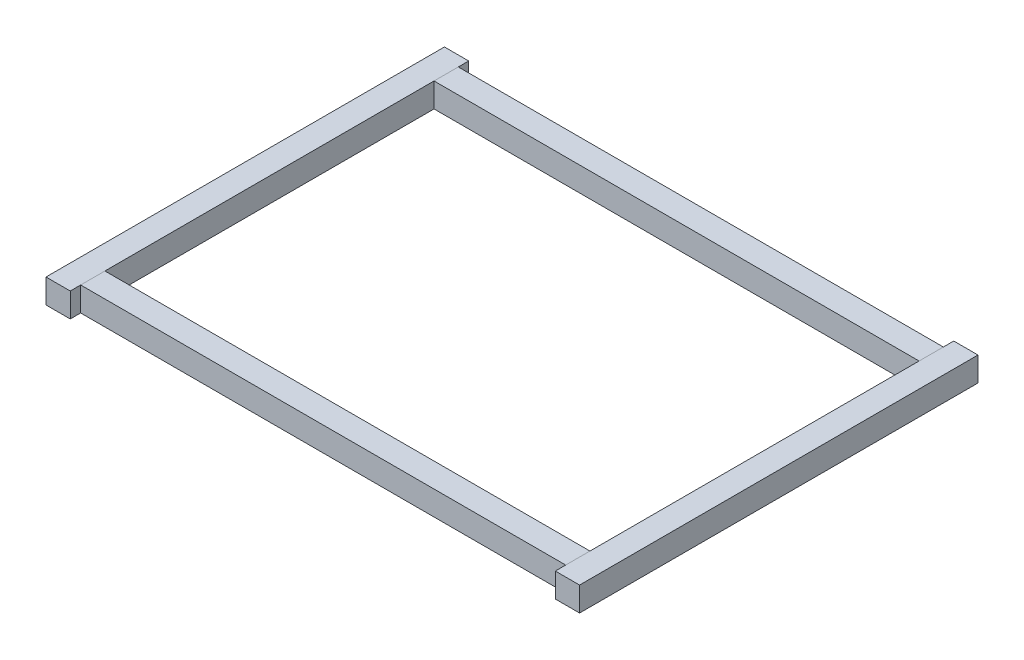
ISO-10303-21;
HEADER;
FILE_DESCRIPTION(('STEP AP214'),'2;1');
FILE_NAME('part.step','',(''),(''),'','','');
FILE_SCHEMA(('AUTOMOTIVE_DESIGN { 1 0 10303 214 1 1 1 1 }'));
ENDSEC;
DATA;
#1=APPLICATION_CONTEXT('core data for automotive mechanical design processes');
#2=APPLICATION_PROTOCOL_DEFINITION('international standard','automotive_design',2000,#1);
#3=PRODUCT_CONTEXT('',#1,'mechanical');
#4=PRODUCT('Part','Part','',(#3));
#5=PRODUCT_RELATED_PRODUCT_CATEGORY('part','',(#4));
#6=PRODUCT_DEFINITION_FORMATION('','',#4);
#7=PRODUCT_DEFINITION_CONTEXT('part definition',#1,'design');
#8=PRODUCT_DEFINITION('design','',#6,#7);
#9=PRODUCT_DEFINITION_SHAPE('','',#8);
#10=(LENGTH_UNIT() NAMED_UNIT(*) SI_UNIT(.MILLI.,.METRE.));
#11=(NAMED_UNIT(*) PLANE_ANGLE_UNIT() SI_UNIT($,.RADIAN.));
#12=(NAMED_UNIT(*) SI_UNIT($,.STERADIAN.) SOLID_ANGLE_UNIT());
#13=UNCERTAINTY_MEASURE_WITH_UNIT(LENGTH_MEASURE(1.E-05),#10,'distance_accuracy_value','');
#14=(GEOMETRIC_REPRESENTATION_CONTEXT(3) GLOBAL_UNCERTAINTY_ASSIGNED_CONTEXT((#13)) GLOBAL_UNIT_ASSIGNED_CONTEXT((#10,
#11,#12)) REPRESENTATION_CONTEXT('',''));
#15=CARTESIAN_POINT('',(0.,0.,0.));
#16=DIRECTION('',(0.,0.,1.));
#17=DIRECTION('',(1.,0.,0.));
#18=AXIS2_PLACEMENT_3D('',#15,#16,#17);
#19=CARTESIAN_POINT('',(280.,0.,230.));
#20=DIRECTION('',(1.,0.,0.));
#21=DIRECTION('',(0.,0.,-1.));
#22=AXIS2_PLACEMENT_3D('',#19,#20,#21);
#23=PLANE('',#22);
#24=DIRECTION('',(0.,-1.,0.));
#25=VECTOR('',#24,1.);
#26=CARTESIAN_POINT('',(279.999999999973,14.,224.));
#27=LINE('',#26,#25);
#28=CARTESIAN_POINT('',(280.000000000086,14.,224.));
#29=VERTEX_POINT('',#28);
#30=CARTESIAN_POINT('',(280.000000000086,0.,224.));
#31=VERTEX_POINT('',#30);
#32=EDGE_CURVE('E95',#29,#31,#27,.T.);
#33=ORIENTED_EDGE('',*,*,#32,.T.);
#34=DIRECTION('',(0.,0.,-1.));
#35=VECTOR('',#34,1.);
#36=CARTESIAN_POINT('',(280.,0.,230.));
#37=LINE('',#36,#35);
#38=CARTESIAN_POINT('',(280.000000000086,0.,210.));
#39=VERTEX_POINT('',#38);
#40=EDGE_CURVE('E93',#31,#39,#37,.T.);
#41=ORIENTED_EDGE('',*,*,#40,.T.);
#42=DIRECTION('',(0.,1.,0.));
#43=VECTOR('',#42,1.);
#44=CARTESIAN_POINT('',(279.999999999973,14.,210.));
#45=LINE('',#44,#43);
#46=CARTESIAN_POINT('',(280.000000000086,14.,210.));
#47=VERTEX_POINT('',#46);
#48=EDGE_CURVE('E48',#39,#47,#45,.T.);
#49=ORIENTED_EDGE('',*,*,#48,.T.);
#50=DIRECTION('',(0.,0.,-1.));
#51=VECTOR('',#50,1.);
#52=CARTESIAN_POINT('',(280.,14.,230.));
#53=LINE('',#52,#51);
#54=EDGE_CURVE('E104',#29,#47,#53,.T.);
#55=ORIENTED_EDGE('',*,*,#54,.F.);
#56=EDGE_LOOP('',(#33,#41,#49,#55));
#57=FACE_BOUND('',#56,.T.);
#58=ADVANCED_FACE('F44',(#57),#23,.T.);
#59=CARTESIAN_POINT('',(500000.,0.,224.));
#60=DIRECTION('',(0.,1.,0.));
#61=DIRECTION('',(0.,0.,1.));
#62=AXIS2_PLACEMENT_3D('',#59,#60,#61);
#63=PLANE('',#62);
#64=ORIENTED_EDGE('',*,*,#40,.F.);
#65=DIRECTION('',(-1.,0.,0.));
#66=VECTOR('',#65,1.);
#67=CARTESIAN_POINT('',(500000.,0.,224.));
#68=LINE('',#67,#66);
#69=CARTESIAN_POINT('',(0.,0.,224.));
#70=VERTEX_POINT('',#69);
#71=EDGE_CURVE('E101',#31,#70,#68,.T.);
#72=ORIENTED_EDGE('',*,*,#71,.T.);
#73=DIRECTION('',(0.,0.,-1.));
#74=VECTOR('',#73,1.);
#75=CARTESIAN_POINT('',(0.,0.,224.));
#76=LINE('',#75,#74);
#77=CARTESIAN_POINT('',(0.,0.,210.));
#78=VERTEX_POINT('',#77);
#79=EDGE_CURVE('E53',#70,#78,#76,.T.);
#80=ORIENTED_EDGE('',*,*,#79,.T.);
#81=DIRECTION('',(-1.,0.,0.));
#82=VECTOR('',#81,1.);
#83=CARTESIAN_POINT('',(500000.,0.,210.));
#84=LINE('',#83,#82);
#85=EDGE_CURVE('E90',#39,#78,#84,.T.);
#86=ORIENTED_EDGE('',*,*,#85,.F.);
#87=EDGE_LOOP('',(#64,#72,#80,#86));
#88=FACE_BOUND('',#87,.T.);
#89=ADVANCED_FACE('F98',(#88),#63,.F.);
#90=CARTESIAN_POINT('',(0.,0.,224.));
#91=DIRECTION('',(1.,0.,0.));
#92=DIRECTION('',(0.,0.,-1.));
#93=AXIS2_PLACEMENT_3D('',#90,#91,#92);
#94=PLANE('',#93);
#95=DIRECTION('',(0.,-1.,0.));
#96=VECTOR('',#95,1.);
#97=CARTESIAN_POINT('',(0.,14.,224.));
#98=LINE('',#97,#96);
#99=CARTESIAN_POINT('',(0.,14.,224.));
#100=VERTEX_POINT('',#99);
#101=EDGE_CURVE('E12',#100,#70,#98,.T.);
#102=ORIENTED_EDGE('',*,*,#101,.F.);
#103=DIRECTION('',(0.,0.,1.));
#104=VECTOR('',#103,1.);
#105=CARTESIAN_POINT('',(0.,14.,224.));
#106=LINE('',#105,#104);
#107=CARTESIAN_POINT('',(0.,14.,210.));
#108=VERTEX_POINT('',#107);
#109=EDGE_CURVE('E109',#108,#100,#106,.T.);
#110=ORIENTED_EDGE('',*,*,#109,.F.);
#111=DIRECTION('',(0.,1.,0.));
#112=VECTOR('',#111,1.);
#113=CARTESIAN_POINT('',(0.,14.,210.));
#114=LINE('',#113,#112);
#115=EDGE_CURVE('E112',#78,#108,#114,.T.);
#116=ORIENTED_EDGE('',*,*,#115,.F.);
#117=ORIENTED_EDGE('',*,*,#79,.F.);
#118=EDGE_LOOP('',(#102,#110,#116,#117));
#119=FACE_BOUND('',#118,.T.);
#120=ADVANCED_FACE('F118',(#119),#94,.F.);
#121=CARTESIAN_POINT('',(500000.,14.,210.));
#122=DIRECTION('',(0.,0.,1.));
#123=DIRECTION('',(1.,0.,0.));
#124=AXIS2_PLACEMENT_3D('',#121,#122,#123);
#125=PLANE('',#124);
#126=ORIENTED_EDGE('',*,*,#48,.F.);
#127=ORIENTED_EDGE('',*,*,#85,.T.);
#128=ORIENTED_EDGE('',*,*,#115,.T.);
#129=DIRECTION('',(-1.,0.,0.));
#130=VECTOR('',#129,1.);
#131=CARTESIAN_POINT('',(500000.,14.,210.));
#132=LINE('',#131,#130);
#133=EDGE_CURVE('E67',#47,#108,#132,.T.);
#134=ORIENTED_EDGE('',*,*,#133,.F.);
#135=EDGE_LOOP('',(#126,#127,#128,#134));
#136=FACE_BOUND('',#135,.T.);
#137=ADVANCED_FACE('F88',(#136),#125,.F.);
#138=CARTESIAN_POINT('',(500000.,14.,224.));
#139=DIRECTION('',(0.,0.,-1.));
#140=DIRECTION('',(-1.,0.,0.));
#141=AXIS2_PLACEMENT_3D('',#138,#139,#140);
#142=PLANE('',#141);
#143=ORIENTED_EDGE('',*,*,#32,.F.);
#144=DIRECTION('',(-1.,0.,0.));
#145=VECTOR('',#144,1.);
#146=CARTESIAN_POINT('',(500000.,14.,224.));
#147=LINE('',#146,#145);
#148=EDGE_CURVE('E60',#29,#100,#147,.T.);
#149=ORIENTED_EDGE('',*,*,#148,.T.);
#150=ORIENTED_EDGE('',*,*,#101,.T.);
#151=ORIENTED_EDGE('',*,*,#71,.F.);
#152=EDGE_LOOP('',(#143,#149,#150,#151));
#153=FACE_BOUND('',#152,.T.);
#154=ADVANCED_FACE('F46',(#153),#142,.F.);
#155=CARTESIAN_POINT('',(500000.,14.,224.));
#156=DIRECTION('',(0.,-1.,0.));
#157=DIRECTION('',(0.,0.,-1.));
#158=AXIS2_PLACEMENT_3D('',#155,#156,#157);
#159=PLANE('',#158);
#160=ORIENTED_EDGE('',*,*,#148,.F.);
#161=ORIENTED_EDGE('',*,*,#54,.T.);
#162=ORIENTED_EDGE('',*,*,#133,.T.);
#163=ORIENTED_EDGE('',*,*,#109,.T.);
#164=EDGE_LOOP('',(#160,#161,#162,#163));
#165=FACE_BOUND('',#164,.T.);
#166=ADVANCED_FACE('F116',(#165),#159,.F.);
#167=CLOSED_SHELL('',(#58,#89,#120,#137,#154,#166));
#168=MANIFOLD_SOLID_BREP('B2',#167);
#169=CARTESIAN_POINT('',(280.,0.,230.));
#170=DIRECTION('',(1.,0.,0.));
#171=DIRECTION('',(0.,0.,-1.));
#172=AXIS2_PLACEMENT_3D('',#169,#170,#171);
#173=PLANE('',#172);
#174=DIRECTION('',(0.,-1.,0.));
#175=VECTOR('',#174,1.);
#176=CARTESIAN_POINT('',(279.999999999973,14.,20.));
#177=LINE('',#176,#175);
#178=CARTESIAN_POINT('',(280.000000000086,14.,20.));
#179=VERTEX_POINT('',#178);
#180=CARTESIAN_POINT('',(280.000000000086,0.,20.));
#181=VERTEX_POINT('',#180);
#182=EDGE_CURVE('E229',#179,#181,#177,.T.);
#183=ORIENTED_EDGE('',*,*,#182,.T.);
#184=DIRECTION('',(0.,0.,-1.));
#185=VECTOR('',#184,1.);
#186=CARTESIAN_POINT('',(280.,0.,230.));
#187=LINE('',#186,#185);
#188=CARTESIAN_POINT('',(280.000000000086,0.,6.00000000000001));
#189=VERTEX_POINT('',#188);
#190=EDGE_CURVE('E227',#181,#189,#187,.T.);
#191=ORIENTED_EDGE('',*,*,#190,.T.);
#192=DIRECTION('',(0.,1.,0.));
#193=VECTOR('',#192,1.);
#194=CARTESIAN_POINT('',(279.999999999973,14.,5.99999999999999));
#195=LINE('',#194,#193);
#196=CARTESIAN_POINT('',(280.000000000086,14.,5.99999999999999));
#197=VERTEX_POINT('',#196);
#198=EDGE_CURVE('E182',#189,#197,#195,.T.);
#199=ORIENTED_EDGE('',*,*,#198,.T.);
#200=DIRECTION('',(0.,0.,-1.));
#201=VECTOR('',#200,1.);
#202=CARTESIAN_POINT('',(280.,14.,230.));
#203=LINE('',#202,#201);
#204=EDGE_CURVE('E238',#179,#197,#203,.T.);
#205=ORIENTED_EDGE('',*,*,#204,.F.);
#206=EDGE_LOOP('',(#183,#191,#199,#205));
#207=FACE_BOUND('',#206,.T.);
#208=ADVANCED_FACE('F178',(#207),#173,.T.);
#209=CARTESIAN_POINT('',(500000.,0.,20.));
#210=DIRECTION('',(0.,1.,0.));
#211=DIRECTION('',(0.,0.,1.));
#212=AXIS2_PLACEMENT_3D('',#209,#210,#211);
#213=PLANE('',#212);
#214=ORIENTED_EDGE('',*,*,#190,.F.);
#215=DIRECTION('',(-1.,0.,0.));
#216=VECTOR('',#215,1.);
#217=CARTESIAN_POINT('',(500000.,0.,20.));
#218=LINE('',#217,#216);
#219=CARTESIAN_POINT('',(0.,0.,20.));
#220=VERTEX_POINT('',#219);
#221=EDGE_CURVE('E235',#181,#220,#218,.T.);
#222=ORIENTED_EDGE('',*,*,#221,.T.);
#223=DIRECTION('',(0.,0.,-1.));
#224=VECTOR('',#223,1.);
#225=CARTESIAN_POINT('',(0.,0.,20.));
#226=LINE('',#225,#224);
#227=CARTESIAN_POINT('',(0.,0.,6.00000000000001));
#228=VERTEX_POINT('',#227);
#229=EDGE_CURVE('E187',#220,#228,#226,.T.);
#230=ORIENTED_EDGE('',*,*,#229,.T.);
#231=DIRECTION('',(-1.,0.,0.));
#232=VECTOR('',#231,1.);
#233=CARTESIAN_POINT('',(500000.,0.,6.00000000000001));
#234=LINE('',#233,#232);
#235=EDGE_CURVE('E224',#189,#228,#234,.T.);
#236=ORIENTED_EDGE('',*,*,#235,.F.);
#237=EDGE_LOOP('',(#214,#222,#230,#236));
#238=FACE_BOUND('',#237,.T.);
#239=ADVANCED_FACE('F232',(#238),#213,.F.);
#240=CARTESIAN_POINT('',(0.,0.,20.));
#241=DIRECTION('',(1.,0.,0.));
#242=DIRECTION('',(0.,0.,-1.));
#243=AXIS2_PLACEMENT_3D('',#240,#241,#242);
#244=PLANE('',#243);
#245=DIRECTION('',(0.,-1.,0.));
#246=VECTOR('',#245,1.);
#247=CARTESIAN_POINT('',(0.,14.,20.));
#248=LINE('',#247,#246);
#249=CARTESIAN_POINT('',(0.,14.,20.));
#250=VERTEX_POINT('',#249);
#251=EDGE_CURVE('E42',#250,#220,#248,.T.);
#252=ORIENTED_EDGE('',*,*,#251,.F.);
#253=DIRECTION('',(0.,0.,1.));
#254=VECTOR('',#253,1.);
#255=CARTESIAN_POINT('',(0.,14.,20.));
#256=LINE('',#255,#254);
#257=CARTESIAN_POINT('',(0.,14.,5.99999999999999));
#258=VERTEX_POINT('',#257);
#259=EDGE_CURVE('E243',#258,#250,#256,.T.);
#260=ORIENTED_EDGE('',*,*,#259,.F.);
#261=DIRECTION('',(0.,1.,0.));
#262=VECTOR('',#261,1.);
#263=CARTESIAN_POINT('',(0.,14.,5.99999999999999));
#264=LINE('',#263,#262);
#265=EDGE_CURVE('E246',#228,#258,#264,.T.);
#266=ORIENTED_EDGE('',*,*,#265,.F.);
#267=ORIENTED_EDGE('',*,*,#229,.F.);
#268=EDGE_LOOP('',(#252,#260,#266,#267));
#269=FACE_BOUND('',#268,.T.);
#270=ADVANCED_FACE('F252',(#269),#244,.F.);
#271=CARTESIAN_POINT('',(500000.,14.,5.99999999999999));
#272=DIRECTION('',(0.,0.,1.));
#273=DIRECTION('',(0.,-1.,0.));
#274=AXIS2_PLACEMENT_3D('',#271,#272,#273);
#275=PLANE('',#274);
#276=ORIENTED_EDGE('',*,*,#198,.F.);
#277=ORIENTED_EDGE('',*,*,#235,.T.);
#278=ORIENTED_EDGE('',*,*,#265,.T.);
#279=DIRECTION('',(-1.,0.,0.));
#280=VECTOR('',#279,1.);
#281=CARTESIAN_POINT('',(500000.,14.,5.99999999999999));
#282=LINE('',#281,#280);
#283=EDGE_CURVE('E201',#197,#258,#282,.T.);
#284=ORIENTED_EDGE('',*,*,#283,.F.);
#285=EDGE_LOOP('',(#276,#277,#278,#284));
#286=FACE_BOUND('',#285,.T.);
#287=ADVANCED_FACE('F222',(#286),#275,.F.);
#288=CARTESIAN_POINT('',(500000.,14.,20.));
#289=DIRECTION('',(0.,0.,-1.));
#290=DIRECTION('',(0.,1.,0.));
#291=AXIS2_PLACEMENT_3D('',#288,#289,#290);
#292=PLANE('',#291);
#293=ORIENTED_EDGE('',*,*,#182,.F.);
#294=DIRECTION('',(-1.,0.,0.));
#295=VECTOR('',#294,1.);
#296=CARTESIAN_POINT('',(500000.,14.,20.));
#297=LINE('',#296,#295);
#298=EDGE_CURVE('E194',#179,#250,#297,.T.);
#299=ORIENTED_EDGE('',*,*,#298,.T.);
#300=ORIENTED_EDGE('',*,*,#251,.T.);
#301=ORIENTED_EDGE('',*,*,#221,.F.);
#302=EDGE_LOOP('',(#293,#299,#300,#301));
#303=FACE_BOUND('',#302,.T.);
#304=ADVANCED_FACE('F180',(#303),#292,.F.);
#305=CARTESIAN_POINT('',(500000.,14.,20.));
#306=DIRECTION('',(0.,-1.,0.));
#307=DIRECTION('',(0.,0.,-1.));
#308=AXIS2_PLACEMENT_3D('',#305,#306,#307);
#309=PLANE('',#308);
#310=ORIENTED_EDGE('',*,*,#298,.F.);
#311=ORIENTED_EDGE('',*,*,#204,.T.);
#312=ORIENTED_EDGE('',*,*,#283,.T.);
#313=ORIENTED_EDGE('',*,*,#259,.T.);
#314=EDGE_LOOP('',(#310,#311,#312,#313));
#315=FACE_BOUND('',#314,.T.);
#316=ADVANCED_FACE('F250',(#315),#309,.F.);
#317=CLOSED_SHELL('',(#208,#239,#270,#287,#304,#316));
#318=MANIFOLD_SOLID_BREP('B6',#317);
#319=CARTESIAN_POINT('',(294.,0.,230.));
#320=DIRECTION('',(0.,1.,0.));
#321=DIRECTION('',(-1.,0.,0.));
#322=AXIS2_PLACEMENT_3D('',#319,#320,#321);
#323=PLANE('',#322);
#324=DIRECTION('',(1.,0.,0.));
#325=VECTOR('',#324,1.);
#326=CARTESIAN_POINT('',(294.,0.,0.));
#327=LINE('',#326,#325);
#328=CARTESIAN_POINT('',(280.,0.,0.));
#329=VERTEX_POINT('',#328);
#330=CARTESIAN_POINT('',(294.,0.,0.));
#331=VERTEX_POINT('',#330);
#332=EDGE_CURVE('E374',#329,#331,#327,.T.);
#333=ORIENTED_EDGE('',*,*,#332,.T.);
#334=DIRECTION('',(0.,0.,-1.));
#335=VECTOR('',#334,1.);
#336=CARTESIAN_POINT('',(294.,0.,230.));
#337=LINE('',#336,#335);
#338=CARTESIAN_POINT('',(294.,0.,230.));
#339=VERTEX_POINT('',#338);
#340=EDGE_CURVE('E176',#339,#331,#337,.T.);
#341=ORIENTED_EDGE('',*,*,#340,.F.);
#342=DIRECTION('',(1.,0.,0.));
#343=VECTOR('',#342,1.);
#344=CARTESIAN_POINT('',(294.,0.,230.));
#345=LINE('',#344,#343);
#346=CARTESIAN_POINT('',(280.,0.,230.));
#347=VERTEX_POINT('',#346);
#348=EDGE_CURVE('E362',#347,#339,#345,.T.);
#349=ORIENTED_EDGE('',*,*,#348,.F.);
#350=DIRECTION('',(0.,0.,-1.));
#351=VECTOR('',#350,1.);
#352=CARTESIAN_POINT('',(280.,0.,230.));
#353=LINE('',#352,#351);
#354=EDGE_CURVE('E370',#347,#329,#353,.T.);
#355=ORIENTED_EDGE('',*,*,#354,.T.);
#356=EDGE_LOOP('',(#333,#341,#349,#355));
#357=FACE_BOUND('',#356,.T.);
#358=ADVANCED_FACE('F311',(#357),#323,.F.);
#359=CARTESIAN_POINT('',(294.,0.,230.));
#360=DIRECTION('',(-1.,0.,0.));
#361=DIRECTION('',(0.,0.,1.));
#362=AXIS2_PLACEMENT_3D('',#359,#360,#361);
#363=PLANE('',#362);
#364=DIRECTION('',(0.,1.,0.));
#365=VECTOR('',#364,1.);
#366=CARTESIAN_POINT('',(294.,0.,0.));
#367=LINE('',#366,#365);
#368=CARTESIAN_POINT('',(294.,14.,0.));
#369=VERTEX_POINT('',#368);
#370=EDGE_CURVE('E366',#331,#369,#367,.T.);
#371=ORIENTED_EDGE('',*,*,#370,.T.);
#372=DIRECTION('',(0.,0.,-1.));
#373=VECTOR('',#372,1.);
#374=CARTESIAN_POINT('',(294.,14.,230.));
#375=LINE('',#374,#373);
#376=CARTESIAN_POINT('',(294.,14.,230.));
#377=VERTEX_POINT('',#376);
#378=EDGE_CURVE('E319',#377,#369,#375,.T.);
#379=ORIENTED_EDGE('',*,*,#378,.F.);
#380=DIRECTION('',(0.,1.,0.));
#381=VECTOR('',#380,1.);
#382=CARTESIAN_POINT('',(294.,0.,230.));
#383=LINE('',#382,#381);
#384=EDGE_CURVE('E357',#339,#377,#383,.T.);
#385=ORIENTED_EDGE('',*,*,#384,.F.);
#386=ORIENTED_EDGE('',*,*,#340,.T.);
#387=EDGE_LOOP('',(#371,#379,#385,#386));
#388=FACE_BOUND('',#387,.T.);
#389=ADVANCED_FACE('F365',(#388),#363,.F.);
#390=CARTESIAN_POINT('',(294.,14.,230.));
#391=DIRECTION('',(0.,-1.,0.));
#392=DIRECTION('',(1.,0.,0.));
#393=AXIS2_PLACEMENT_3D('',#390,#391,#392);
#394=PLANE('',#393);
#395=DIRECTION('',(-1.,0.,0.));
#396=VECTOR('',#395,1.);
#397=CARTESIAN_POINT('',(294.,14.,0.));
#398=LINE('',#397,#396);
#399=CARTESIAN_POINT('',(280.,14.,0.));
#400=VERTEX_POINT('',#399);
#401=EDGE_CURVE('E344',#369,#400,#398,.T.);
#402=ORIENTED_EDGE('',*,*,#401,.T.);
#403=DIRECTION('',(0.,0.,-1.));
#404=VECTOR('',#403,1.);
#405=CARTESIAN_POINT('',(280.,14.,230.));
#406=LINE('',#405,#404);
#407=CARTESIAN_POINT('',(280.,14.,230.));
#408=VERTEX_POINT('',#407);
#409=EDGE_CURVE('E367',#408,#400,#406,.T.);
#410=ORIENTED_EDGE('',*,*,#409,.F.);
#411=DIRECTION('',(-1.,0.,0.));
#412=VECTOR('',#411,1.);
#413=CARTESIAN_POINT('',(294.,14.,230.));
#414=LINE('',#413,#412);
#415=EDGE_CURVE('E360',#377,#408,#414,.T.);
#416=ORIENTED_EDGE('',*,*,#415,.F.);
#417=ORIENTED_EDGE('',*,*,#378,.T.);
#418=EDGE_LOOP('',(#402,#410,#416,#417));
#419=FACE_BOUND('',#418,.T.);
#420=ADVANCED_FACE('F368',(#419),#394,.F.);
#421=CARTESIAN_POINT('',(280.,0.,230.));
#422=DIRECTION('',(1.,0.,0.));
#423=DIRECTION('',(0.,0.,-1.));
#424=AXIS2_PLACEMENT_3D('',#421,#422,#423);
#425=PLANE('',#424);
#426=DIRECTION('',(0.,-1.,0.));
#427=VECTOR('',#426,1.);
#428=CARTESIAN_POINT('',(280.,0.,0.));
#429=LINE('',#428,#427);
#430=EDGE_CURVE('E350',#400,#329,#429,.T.);
#431=ORIENTED_EDGE('',*,*,#430,.T.);
#432=ORIENTED_EDGE('',*,*,#354,.F.);
#433=DIRECTION('',(0.,-1.,0.));
#434=VECTOR('',#433,1.);
#435=CARTESIAN_POINT('',(280.,0.,230.));
#436=LINE('',#435,#434);
#437=EDGE_CURVE('E327',#408,#347,#436,.T.);
#438=ORIENTED_EDGE('',*,*,#437,.F.);
#439=ORIENTED_EDGE('',*,*,#409,.T.);
#440=EDGE_LOOP('',(#431,#432,#438,#439));
#441=FACE_BOUND('',#440,.T.);
#442=ADVANCED_FACE('F381',(#441),#425,.F.);
#443=CARTESIAN_POINT('',(280.,0.,230.));
#444=DIRECTION('',(0.,0.,-1.));
#445=DIRECTION('',(-1.,0.,0.));
#446=AXIS2_PLACEMENT_3D('',#443,#444,#445);
#447=PLANE('',#446);
#448=ORIENTED_EDGE('',*,*,#348,.T.);
#449=ORIENTED_EDGE('',*,*,#384,.T.);
#450=ORIENTED_EDGE('',*,*,#415,.T.);
#451=ORIENTED_EDGE('',*,*,#437,.T.);
#452=EDGE_LOOP('',(#448,#449,#450,#451));
#453=FACE_BOUND('',#452,.T.);
#454=ADVANCED_FACE('F358',(#453),#447,.F.);
#455=CARTESIAN_POINT('',(280.,0.,0.));
#456=DIRECTION('',(0.,0.,-1.));
#457=DIRECTION('',(-1.,0.,0.));
#458=AXIS2_PLACEMENT_3D('',#455,#456,#457);
#459=PLANE('',#458);
#460=ORIENTED_EDGE('',*,*,#332,.F.);
#461=ORIENTED_EDGE('',*,*,#430,.F.);
#462=ORIENTED_EDGE('',*,*,#401,.F.);
#463=ORIENTED_EDGE('',*,*,#370,.F.);
#464=EDGE_LOOP('',(#460,#461,#462,#463));
#465=FACE_BOUND('',#464,.T.);
#466=ADVANCED_FACE('F384',(#465),#459,.T.);
#467=CLOSED_SHELL('',(#358,#389,#420,#442,#454,#466));
#468=MANIFOLD_SOLID_BREP('B36',#467);
#469=CARTESIAN_POINT('',(0.,0.,230.));
#470=DIRECTION('',(-1.,0.,0.));
#471=DIRECTION('',(0.,0.,1.));
#472=AXIS2_PLACEMENT_3D('',#469,#470,#471);
#473=PLANE('',#472);
#474=DIRECTION('',(0.,1.,0.));
#475=VECTOR('',#474,1.);
#476=CARTESIAN_POINT('',(0.,0.,0.));
#477=LINE('',#476,#475);
#478=CARTESIAN_POINT('',(0.,0.,0.));
#479=VERTEX_POINT('',#478);
#480=CARTESIAN_POINT('',(0.,14.,0.));
#481=VERTEX_POINT('',#480);
#482=EDGE_CURVE('E498',#479,#481,#477,.T.);
#483=ORIENTED_EDGE('',*,*,#482,.T.);
#484=DIRECTION('',(0.,0.,-1.));
#485=VECTOR('',#484,1.);
#486=CARTESIAN_POINT('',(0.,14.,230.));
#487=LINE('',#486,#485);
#488=CARTESIAN_POINT('',(0.,14.,230.));
#489=VERTEX_POINT('',#488);
#490=EDGE_CURVE('E309',#489,#481,#487,.T.);
#491=ORIENTED_EDGE('',*,*,#490,.F.);
#492=DIRECTION('',(0.,1.,0.));
#493=VECTOR('',#492,1.);
#494=CARTESIAN_POINT('',(0.,0.,230.));
#495=LINE('',#494,#493);
#496=CARTESIAN_POINT('',(0.,0.,230.));
#497=VERTEX_POINT('',#496);
#498=EDGE_CURVE('E486',#497,#489,#495,.T.);
#499=ORIENTED_EDGE('',*,*,#498,.F.);
#500=DIRECTION('',(0.,0.,-1.));
#501=VECTOR('',#500,1.);
#502=CARTESIAN_POINT('',(0.,0.,230.));
#503=LINE('',#502,#501);
#504=EDGE_CURVE('E494',#497,#479,#503,.T.);
#505=ORIENTED_EDGE('',*,*,#504,.T.);
#506=EDGE_LOOP('',(#483,#491,#499,#505));
#507=FACE_BOUND('',#506,.T.);
#508=ADVANCED_FACE('F435',(#507),#473,.F.);
#509=CARTESIAN_POINT('',(0.,14.,230.));
#510=DIRECTION('',(0.,-1.,0.));
#511=DIRECTION('',(1.,0.,0.));
#512=AXIS2_PLACEMENT_3D('',#509,#510,#511);
#513=PLANE('',#512);
#514=DIRECTION('',(-1.,0.,0.));
#515=VECTOR('',#514,1.);
#516=CARTESIAN_POINT('',(0.,14.,0.));
#517=LINE('',#516,#515);
#518=CARTESIAN_POINT('',(-14.,14.,0.));
#519=VERTEX_POINT('',#518);
#520=EDGE_CURVE('E490',#481,#519,#517,.T.);
#521=ORIENTED_EDGE('',*,*,#520,.T.);
#522=DIRECTION('',(0.,0.,-1.));
#523=VECTOR('',#522,1.);
#524=CARTESIAN_POINT('',(-14.,14.,230.));
#525=LINE('',#524,#523);
#526=CARTESIAN_POINT('',(-14.,14.,230.));
#527=VERTEX_POINT('',#526);
#528=EDGE_CURVE('E443',#527,#519,#525,.T.);
#529=ORIENTED_EDGE('',*,*,#528,.F.);
#530=DIRECTION('',(-1.,0.,0.));
#531=VECTOR('',#530,1.);
#532=CARTESIAN_POINT('',(0.,14.,230.));
#533=LINE('',#532,#531);
#534=EDGE_CURVE('E481',#489,#527,#533,.T.);
#535=ORIENTED_EDGE('',*,*,#534,.F.);
#536=ORIENTED_EDGE('',*,*,#490,.T.);
#537=EDGE_LOOP('',(#521,#529,#535,#536));
#538=FACE_BOUND('',#537,.T.);
#539=ADVANCED_FACE('F489',(#538),#513,.F.);
#540=CARTESIAN_POINT('',(-14.,0.,230.));
#541=DIRECTION('',(1.,0.,0.));
#542=DIRECTION('',(0.,0.,-1.));
#543=AXIS2_PLACEMENT_3D('',#540,#541,#542);
#544=PLANE('',#543);
#545=DIRECTION('',(0.,-1.,0.));
#546=VECTOR('',#545,1.);
#547=CARTESIAN_POINT('',(-14.,0.,0.));
#548=LINE('',#547,#546);
#549=CARTESIAN_POINT('',(-14.,0.,0.));
#550=VERTEX_POINT('',#549);
#551=EDGE_CURVE('E468',#519,#550,#548,.T.);
#552=ORIENTED_EDGE('',*,*,#551,.T.);
#553=DIRECTION('',(0.,0.,-1.));
#554=VECTOR('',#553,1.);
#555=CARTESIAN_POINT('',(-14.,0.,230.));
#556=LINE('',#555,#554);
#557=CARTESIAN_POINT('',(-14.,0.,230.));
#558=VERTEX_POINT('',#557);
#559=EDGE_CURVE('E491',#558,#550,#556,.T.);
#560=ORIENTED_EDGE('',*,*,#559,.F.);
#561=DIRECTION('',(0.,-1.,0.));
#562=VECTOR('',#561,1.);
#563=CARTESIAN_POINT('',(-14.,0.,230.));
#564=LINE('',#563,#562);
#565=EDGE_CURVE('E484',#527,#558,#564,.T.);
#566=ORIENTED_EDGE('',*,*,#565,.F.);
#567=ORIENTED_EDGE('',*,*,#528,.T.);
#568=EDGE_LOOP('',(#552,#560,#566,#567));
#569=FACE_BOUND('',#568,.T.);
#570=ADVANCED_FACE('F492',(#569),#544,.F.);
#571=CARTESIAN_POINT('',(0.,0.,230.));
#572=DIRECTION('',(0.,1.,0.));
#573=DIRECTION('',(-1.,0.,0.));
#574=AXIS2_PLACEMENT_3D('',#571,#572,#573);
#575=PLANE('',#574);
#576=DIRECTION('',(1.,0.,0.));
#577=VECTOR('',#576,1.);
#578=CARTESIAN_POINT('',(0.,0.,0.));
#579=LINE('',#578,#577);
#580=EDGE_CURVE('E474',#550,#479,#579,.T.);
#581=ORIENTED_EDGE('',*,*,#580,.T.);
#582=ORIENTED_EDGE('',*,*,#504,.F.);
#583=DIRECTION('',(1.,0.,0.));
#584=VECTOR('',#583,1.);
#585=CARTESIAN_POINT('',(0.,0.,230.));
#586=LINE('',#585,#584);
#587=EDGE_CURVE('E451',#558,#497,#586,.T.);
#588=ORIENTED_EDGE('',*,*,#587,.F.);
#589=ORIENTED_EDGE('',*,*,#559,.T.);
#590=EDGE_LOOP('',(#581,#582,#588,#589));
#591=FACE_BOUND('',#590,.T.);
#592=ADVANCED_FACE('F505',(#591),#575,.F.);
#593=CARTESIAN_POINT('',(0.,14.,230.));
#594=DIRECTION('',(0.,0.,1.));
#595=DIRECTION('',(1.,0.,0.));
#596=AXIS2_PLACEMENT_3D('',#593,#594,#595);
#597=PLANE('',#596);
#598=ORIENTED_EDGE('',*,*,#498,.T.);
#599=ORIENTED_EDGE('',*,*,#534,.T.);
#600=ORIENTED_EDGE('',*,*,#565,.T.);
#601=ORIENTED_EDGE('',*,*,#587,.T.);
#602=EDGE_LOOP('',(#598,#599,#600,#601));
#603=FACE_BOUND('',#602,.T.);
#604=ADVANCED_FACE('F482',(#603),#597,.T.);
#605=CARTESIAN_POINT('',(0.,14.,0.));
#606=DIRECTION('',(0.,0.,1.));
#607=DIRECTION('',(1.,0.,0.));
#608=AXIS2_PLACEMENT_3D('',#605,#606,#607);
#609=PLANE('',#608);
#610=ORIENTED_EDGE('',*,*,#482,.F.);
#611=ORIENTED_EDGE('',*,*,#580,.F.);
#612=ORIENTED_EDGE('',*,*,#551,.F.);
#613=ORIENTED_EDGE('',*,*,#520,.F.);
#614=EDGE_LOOP('',(#610,#611,#612,#613));
#615=FACE_BOUND('',#614,.T.);
#616=ADVANCED_FACE('F508',(#615),#609,.F.);
#617=CLOSED_SHELL('',(#508,#539,#570,#592,#604,#616));
#618=MANIFOLD_SOLID_BREP('B170',#617);
#619=ADVANCED_BREP_SHAPE_REPRESENTATION('',(#18,#168,#318,#468,#618),#14);
#620=SHAPE_DEFINITION_REPRESENTATION(#9,#619);
ENDSEC;
END-ISO-10303-21;
